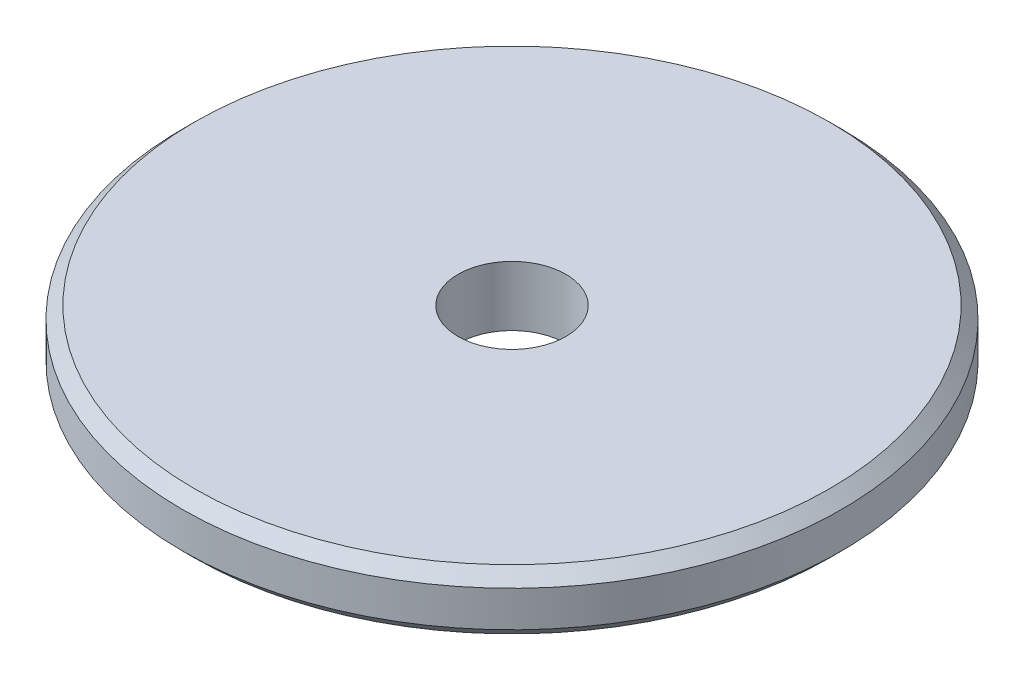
ISO-10303-21;
HEADER;
FILE_DESCRIPTION(('STEP AP214'),'2;1');
FILE_NAME('part.step','',(''),(''),'','','');
FILE_SCHEMA(('AUTOMOTIVE_DESIGN { 1 0 10303 214 1 1 1 1 }'));
ENDSEC;
DATA;
#1=APPLICATION_CONTEXT('core data for automotive mechanical design processes');
#2=APPLICATION_PROTOCOL_DEFINITION('international standard','automotive_design',2000,#1);
#3=PRODUCT_CONTEXT('',#1,'mechanical');
#4=PRODUCT('Part','Part','',(#3));
#5=PRODUCT_RELATED_PRODUCT_CATEGORY('part','',(#4));
#6=PRODUCT_DEFINITION_FORMATION('','',#4);
#7=PRODUCT_DEFINITION_CONTEXT('part definition',#1,'design');
#8=PRODUCT_DEFINITION('design','',#6,#7);
#9=PRODUCT_DEFINITION_SHAPE('','',#8);
#10=(LENGTH_UNIT() NAMED_UNIT(*) SI_UNIT(.MILLI.,.METRE.));
#11=(NAMED_UNIT(*) PLANE_ANGLE_UNIT() SI_UNIT($,.RADIAN.));
#12=(NAMED_UNIT(*) SI_UNIT($,.STERADIAN.) SOLID_ANGLE_UNIT());
#13=UNCERTAINTY_MEASURE_WITH_UNIT(LENGTH_MEASURE(1.E-05),#10,'distance_accuracy_value','');
#14=(GEOMETRIC_REPRESENTATION_CONTEXT(3) GLOBAL_UNCERTAINTY_ASSIGNED_CONTEXT((#13)) GLOBAL_UNIT_ASSIGNED_CONTEXT((#10,
#11,#12)) REPRESENTATION_CONTEXT('',''));
#15=CARTESIAN_POINT('',(0.,0.,0.));
#16=DIRECTION('',(0.,0.,1.));
#17=DIRECTION('',(1.,0.,0.));
#18=AXIS2_PLACEMENT_3D('',#15,#16,#17);
#19=CARTESIAN_POINT('',(0.,5.,0.));
#20=DIRECTION('',(0.,1.,0.));
#21=DIRECTION('',(0.,0.,1.));
#22=AXIS2_PLACEMENT_3D('',#19,#20,#21);
#23=PLANE('',#22);
#24=CARTESIAN_POINT('',(0.,5.,0.));
#25=DIRECTION('',(0.,1.,0.));
#26=DIRECTION('',(0.,0.,1.));
#27=AXIS2_PLACEMENT_3D('',#24,#25,#26);
#28=CIRCLE('',#27,26.5);
#29=CARTESIAN_POINT('',(0.,5.,26.5));
#30=VERTEX_POINT('',#29);
#31=EDGE_CURVE('E10',#30,#30,#28,.T.);
#32=ORIENTED_EDGE('',*,*,#31,.T.);
#33=EDGE_LOOP('',(#32));
#34=FACE_BOUND('',#33,.T.);
#35=CARTESIAN_POINT('',(0.,5.,0.));
#36=DIRECTION('',(0.,1.,0.));
#37=DIRECTION('',(0.,0.,1.));
#38=AXIS2_PLACEMENT_3D('',#35,#36,#37);
#39=CIRCLE('',#38,4.5);
#40=CARTESIAN_POINT('',(0.,5.,4.5));
#41=VERTEX_POINT('',#40);
#42=EDGE_CURVE('E49',#41,#41,#39,.T.);
#43=ORIENTED_EDGE('',*,*,#42,.F.);
#44=EDGE_LOOP('',(#43));
#45=FACE_BOUND('',#44,.T.);
#46=ADVANCED_FACE('F29',(#34,#45),#23,.T.);
#47=CARTESIAN_POINT('',(0.,0.,0.));
#48=DIRECTION('',(0.,1.,0.));
#49=DIRECTION('',(0.,0.,1.));
#50=AXIS2_PLACEMENT_3D('',#47,#48,#49);
#51=PLANE('',#50);
#52=CARTESIAN_POINT('',(0.,0.,0.));
#53=DIRECTION('',(0.,1.,0.));
#54=DIRECTION('',(0.,0.,1.));
#55=AXIS2_PLACEMENT_3D('',#52,#53,#54);
#56=CIRCLE('',#55,26.5);
#57=CARTESIAN_POINT('',(0.,0.,26.5));
#58=VERTEX_POINT('',#57);
#59=EDGE_CURVE('E36',#58,#58,#56,.F.);
#60=ORIENTED_EDGE('',*,*,#59,.T.);
#61=EDGE_LOOP('',(#60));
#62=FACE_BOUND('',#61,.T.);
#63=CARTESIAN_POINT('',(0.,0.,0.));
#64=DIRECTION('',(0.,1.,0.));
#65=DIRECTION('',(0.,0.,1.));
#66=AXIS2_PLACEMENT_3D('',#63,#64,#65);
#67=CIRCLE('',#66,4.5);
#68=CARTESIAN_POINT('',(0.,0.,4.5));
#69=VERTEX_POINT('',#68);
#70=EDGE_CURVE('E50',#69,#69,#67,.T.);
#71=ORIENTED_EDGE('',*,*,#70,.T.);
#72=EDGE_LOOP('',(#71));
#73=FACE_BOUND('',#72,.T.);
#74=ADVANCED_FACE('F60',(#62,#73),#51,.F.);
#75=CARTESIAN_POINT('',(0.,5.,0.));
#76=DIRECTION('',(0.,-1.,0.));
#77=DIRECTION('',(0.,0.,-1.));
#78=AXIS2_PLACEMENT_3D('',#75,#76,#77);
#79=CYLINDRICAL_SURFACE('',#78,27.5);
#80=CARTESIAN_POINT('',(0.,1.00000000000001,0.));
#81=DIRECTION('',(0.,1.,0.));
#82=DIRECTION('',(0.,0.,1.));
#83=AXIS2_PLACEMENT_3D('',#80,#81,#82);
#84=CIRCLE('',#83,27.5);
#85=CARTESIAN_POINT('',(0.,1.00000000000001,27.5));
#86=VERTEX_POINT('',#85);
#87=EDGE_CURVE('E40',#86,#86,#84,.T.);
#88=ORIENTED_EDGE('',*,*,#87,.T.);
#89=EDGE_LOOP('',(#88));
#90=FACE_BOUND('',#89,.T.);
#91=CARTESIAN_POINT('',(0.,4.00000000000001,0.));
#92=DIRECTION('',(0.,1.,0.));
#93=DIRECTION('',(0.,0.,1.));
#94=AXIS2_PLACEMENT_3D('',#91,#92,#93);
#95=CIRCLE('',#94,27.5);
#96=CARTESIAN_POINT('',(0.,4.00000000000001,27.5));
#97=VERTEX_POINT('',#96);
#98=EDGE_CURVE('E44',#97,#97,#95,.F.);
#99=ORIENTED_EDGE('',*,*,#98,.T.);
#100=EDGE_LOOP('',(#99));
#101=FACE_BOUND('',#100,.T.);
#102=ADVANCED_FACE('F65',(#90,#101),#79,.T.);
#103=CARTESIAN_POINT('',(0.,5.,0.));
#104=DIRECTION('',(0.,-1.,0.));
#105=DIRECTION('',(0.,0.,-1.));
#106=AXIS2_PLACEMENT_3D('',#103,#104,#105);
#107=CYLINDRICAL_SURFACE('',#106,4.5);
#108=ORIENTED_EDGE('',*,*,#42,.T.);
#109=EDGE_LOOP('',(#108));
#110=FACE_BOUND('',#109,.T.);
#111=ORIENTED_EDGE('',*,*,#70,.F.);
#112=EDGE_LOOP('',(#111));
#113=FACE_BOUND('',#112,.T.);
#114=ADVANCED_FACE('F56',(#110,#113),#107,.F.);
#115=CARTESIAN_POINT('',(0.,1.00000000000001,0.));
#116=DIRECTION('',(0.,1.,0.));
#117=DIRECTION('',(0.,0.,1.));
#118=AXIS2_PLACEMENT_3D('',#115,#116,#117);
#119=CONICAL_SURFACE('',#118,27.5,0.78539816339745);
#120=ORIENTED_EDGE('',*,*,#59,.F.);
#121=EDGE_LOOP('',(#120));
#122=FACE_BOUND('',#121,.T.);
#123=ORIENTED_EDGE('',*,*,#87,.F.);
#124=EDGE_LOOP('',(#123));
#125=FACE_BOUND('',#124,.T.);
#126=ADVANCED_FACE('F71',(#122,#125),#119,.T.);
#127=CARTESIAN_POINT('',(0.,5.,0.));
#128=DIRECTION('',(0.,-1.,0.));
#129=DIRECTION('',(0.,0.,-1.));
#130=AXIS2_PLACEMENT_3D('',#127,#128,#129);
#131=CONICAL_SURFACE('',#130,26.5,0.785398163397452);
#132=ORIENTED_EDGE('',*,*,#98,.F.);
#133=EDGE_LOOP('',(#132));
#134=FACE_BOUND('',#133,.T.);
#135=ORIENTED_EDGE('',*,*,#31,.F.);
#136=EDGE_LOOP('',(#135));
#137=FACE_BOUND('',#136,.T.);
#138=ADVANCED_FACE('F31',(#134,#137),#131,.T.);
#139=CLOSED_SHELL('',(#46,#74,#102,#114,#126,#138));
#140=MANIFOLD_SOLID_BREP('B2',#139);
#141=ADVANCED_BREP_SHAPE_REPRESENTATION('',(#18,#140),#14);
#142=SHAPE_DEFINITION_REPRESENTATION(#9,#141);
ENDSEC;
END-ISO-10303-21;
